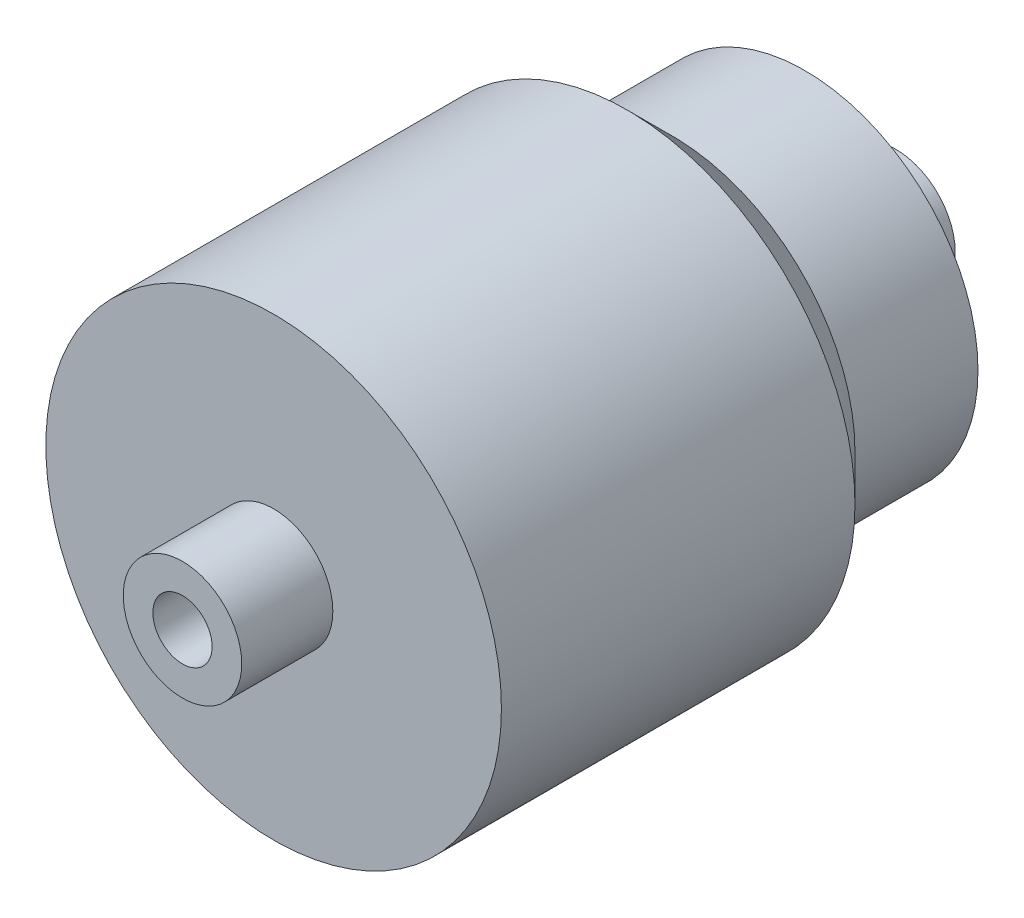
from build123d import *


with BuildPart() as part:
    # Sketch 1 → Revolve 1 (revolve)
    with BuildSketch(Plane(origin=(0, 0, 0), x_dir=(0, 0, -1), z_dir=(1, 0, 0)), mode=Mode.PRIVATE) as revolve_1_sk:
        Polygon((0, 3.25), (78.3, 3.25), (78.3, 6.5), (68.3, 6.5), (68.3, 19), (53.8, 19), (53.8, 20), (48.8, 25), (10, 25), (10, 6.5), (0, 6.5), align=None)
    revolve(revolve_1_sk.sketch.rotate(Axis((0, 0, 0), (0, 0, -1)), 90), axis=Axis((0, 0, 0), (0, 0, -1)))


solid = part.part
